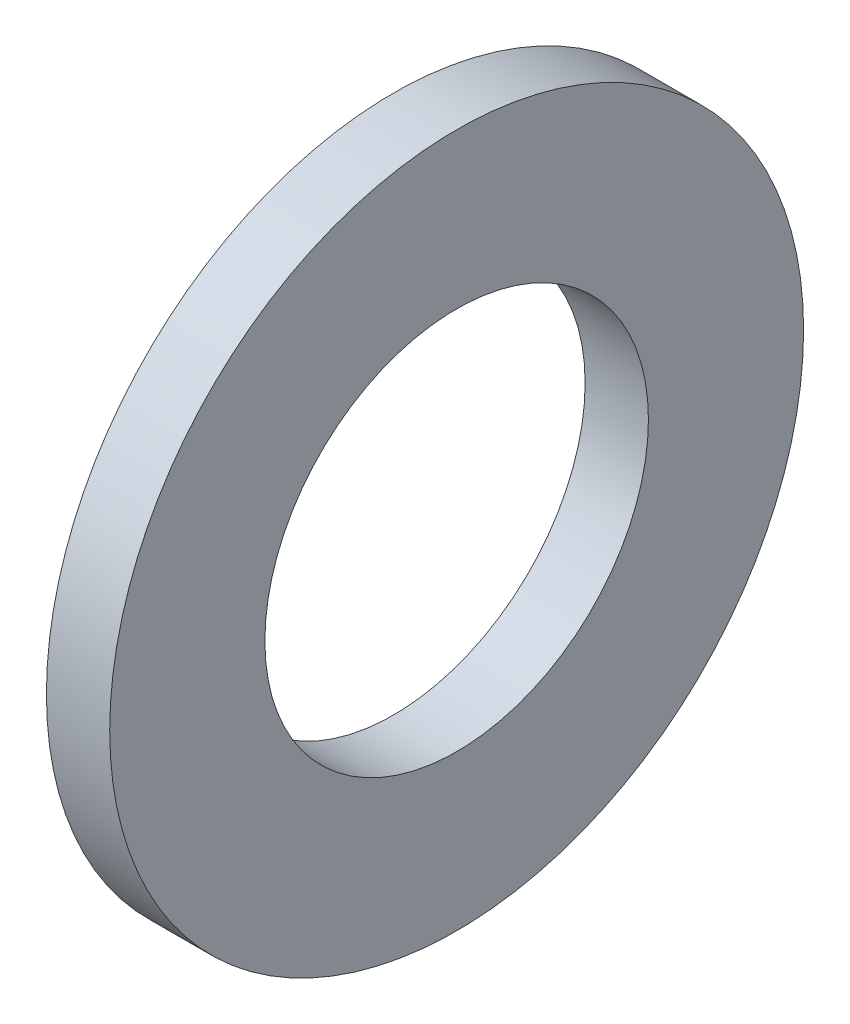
from build123d import *

# Parameters (mm, degrees)
SKETCH1_W = 3.4036
SKETCH1_H = 8.3439


with BuildPart() as part:
    # Sketch1 → Base-Revolve (revolve)
    with BuildSketch(Plane.XY, mode=Mode.PRIVATE) as base_revolve_sk:
        with Locations((-1.7018, 14.48435)):
            Rectangle(SKETCH1_W, SKETCH1_H)
    revolve(base_revolve_sk.sketch.rotate(Axis((-34.925, 0, 0), (1, 0, 0)), 90), axis=Axis((-34.925, 0, 0), (1, 0, 0)))


solid = part.part
